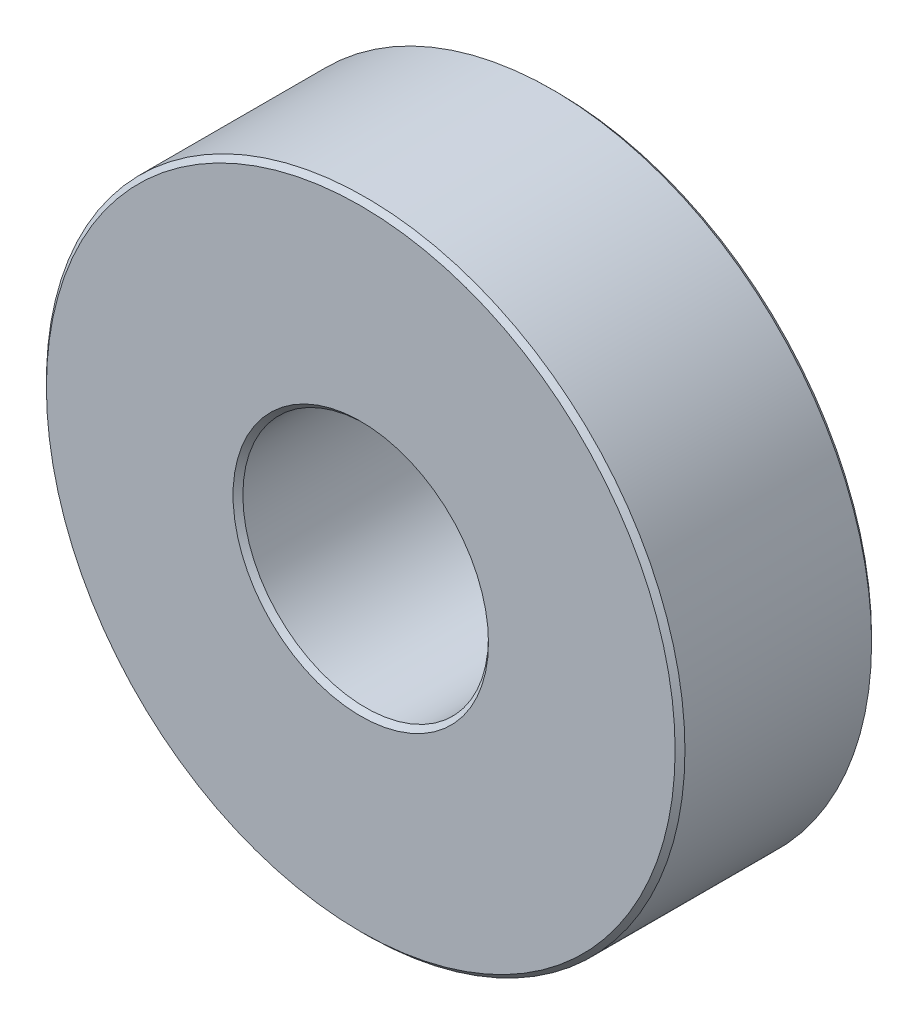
from build123d import *

# Parameters (mm, degrees)
ESQUISSE1_R             = 6.5
BASE_EXTRUSION_DEPTH    = 4
ESQUISSE2_R             = 2.5
ENL_V_MAT_EXTRU_1_DEPTH = 11.024968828
CHANFREIN1_SIZE         = 0.1


with BuildPart() as part:
    # Esquisse1 → Base-Extrusion (new body)
    with BuildSketch(Plane.XY):
        Circle(ESQUISSE1_R)
    extrude(amount=BASE_EXTRUSION_DEPTH)

    # Esquisse2 → Enl_v. mat.-Extru.1 (cut, through all)
    with BuildSketch(Plane.XY.offset(4)):
        Circle(ESQUISSE2_R)
    extrude(amount=-ENL_V_MAT_EXTRU_1_DEPTH, mode=Mode.SUBTRACT)

    # Chanfrein1
    chanfrein1_edges = [part.edges().sort_by_distance(p)[0] for p in [
        (-6.5, 0, 0),
        (-6.5, 0, 4),
        (-2.5, 0, 0),
        (-2.5, 0, 4),
    ]]
    chamfer(chanfrein1_edges, length=CHANFREIN1_SIZE)


solid = part.part
